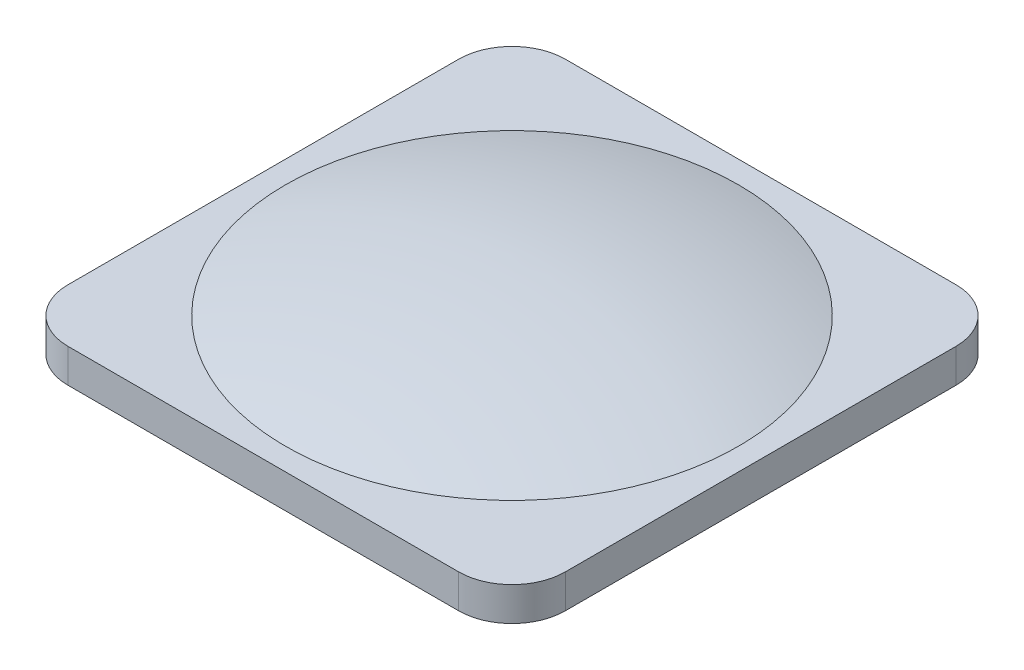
ISO-10303-21;
HEADER;
FILE_DESCRIPTION(('STEP AP214'),'2;1');
FILE_NAME('part.step','',(''),(''),'','','');
FILE_SCHEMA(('AUTOMOTIVE_DESIGN { 1 0 10303 214 1 1 1 1 }'));
ENDSEC;
DATA;
#1=APPLICATION_CONTEXT('core data for automotive mechanical design processes');
#2=APPLICATION_PROTOCOL_DEFINITION('international standard','automotive_design',2000,#1);
#3=PRODUCT_CONTEXT('',#1,'mechanical');
#4=PRODUCT('Part','Part','',(#3));
#5=PRODUCT_RELATED_PRODUCT_CATEGORY('part','',(#4));
#6=PRODUCT_DEFINITION_FORMATION('','',#4);
#7=PRODUCT_DEFINITION_CONTEXT('part definition',#1,'design');
#8=PRODUCT_DEFINITION('design','',#6,#7);
#9=PRODUCT_DEFINITION_SHAPE('','',#8);
#10=(LENGTH_UNIT() NAMED_UNIT(*) SI_UNIT(.MILLI.,.METRE.));
#11=(NAMED_UNIT(*) PLANE_ANGLE_UNIT() SI_UNIT($,.RADIAN.));
#12=(NAMED_UNIT(*) SI_UNIT($,.STERADIAN.) SOLID_ANGLE_UNIT());
#13=UNCERTAINTY_MEASURE_WITH_UNIT(LENGTH_MEASURE(1.E-05),#10,'distance_accuracy_value','');
#14=(GEOMETRIC_REPRESENTATION_CONTEXT(3) GLOBAL_UNCERTAINTY_ASSIGNED_CONTEXT((#13)) GLOBAL_UNIT_ASSIGNED_CONTEXT((#10,
#11,#12)) REPRESENTATION_CONTEXT('',''));
#15=CARTESIAN_POINT('',(0.,0.,0.));
#16=DIRECTION('',(0.,0.,1.));
#17=DIRECTION('',(1.,0.,0.));
#18=AXIS2_PLACEMENT_3D('',#15,#16,#17);
#19=CARTESIAN_POINT('',(0.,0.,-140.));
#20=DIRECTION('',(0.,-1.,0.));
#21=DIRECTION('',(0.,0.,-1.));
#22=AXIS2_PLACEMENT_3D('',#19,#20,#21);
#23=PLANE('',#22);
#24=DIRECTION('',(0.,0.,-1.));
#25=VECTOR('',#24,1.);
#26=CARTESIAN_POINT('',(140.,0.,0.));
#27=LINE('',#26,#25);
#28=CARTESIAN_POINT('',(140.,0.,-15.));
#29=VERTEX_POINT('',#28);
#30=CARTESIAN_POINT('',(140.,0.,-125.));
#31=VERTEX_POINT('',#30);
#32=EDGE_CURVE('E215',#29,#31,#27,.T.);
#33=ORIENTED_EDGE('',*,*,#32,.F.);
#34=CARTESIAN_POINT('',(125.,0.,-15.));
#35=DIRECTION('',(0.,-1.,0.));
#36=DIRECTION('',(0.,0.,-1.));
#37=AXIS2_PLACEMENT_3D('',#34,#35,#36);
#38=CIRCLE('',#37,15.);
#39=CARTESIAN_POINT('',(125.,0.,0.));
#40=VERTEX_POINT('',#39);
#41=EDGE_CURVE('E242',#29,#40,#38,.T.);
#42=ORIENTED_EDGE('',*,*,#41,.T.);
#43=DIRECTION('',(1.,0.,0.));
#44=VECTOR('',#43,1.);
#45=CARTESIAN_POINT('',(0.,0.,0.));
#46=LINE('',#45,#44);
#47=CARTESIAN_POINT('',(15.,0.,0.));
#48=VERTEX_POINT('',#47);
#49=EDGE_CURVE('E212',#48,#40,#46,.T.);
#50=ORIENTED_EDGE('',*,*,#49,.F.);
#51=CARTESIAN_POINT('',(15.,0.,-15.));
#52=DIRECTION('',(0.,-1.,0.));
#53=DIRECTION('',(0.,0.,-1.));
#54=AXIS2_PLACEMENT_3D('',#51,#52,#53);
#55=CIRCLE('',#54,15.);
#56=CARTESIAN_POINT('',(0.,0.,-15.));
#57=VERTEX_POINT('',#56);
#58=EDGE_CURVE('E240',#48,#57,#55,.T.);
#59=ORIENTED_EDGE('',*,*,#58,.T.);
#60=DIRECTION('',(0.,0.,1.));
#61=VECTOR('',#60,1.);
#62=CARTESIAN_POINT('',(0.,0.,0.));
#63=LINE('',#62,#61);
#64=CARTESIAN_POINT('',(0.,0.,-125.));
#65=VERTEX_POINT('',#64);
#66=EDGE_CURVE('E209',#65,#57,#63,.T.);
#67=ORIENTED_EDGE('',*,*,#66,.F.);
#68=CARTESIAN_POINT('',(15.,0.,-125.));
#69=DIRECTION('',(0.,-1.,0.));
#70=DIRECTION('',(0.,0.,-1.));
#71=AXIS2_PLACEMENT_3D('',#68,#69,#70);
#72=CIRCLE('',#71,15.);
#73=CARTESIAN_POINT('',(15.,0.,-140.));
#74=VERTEX_POINT('',#73);
#75=EDGE_CURVE('E238',#65,#74,#72,.T.);
#76=ORIENTED_EDGE('',*,*,#75,.T.);
#77=DIRECTION('',(-1.,0.,0.));
#78=VECTOR('',#77,1.);
#79=CARTESIAN_POINT('',(0.,0.,-140.));
#80=LINE('',#79,#78);
#81=CARTESIAN_POINT('',(125.,0.,-140.));
#82=VERTEX_POINT('',#81);
#83=EDGE_CURVE('E218',#82,#74,#80,.T.);
#84=ORIENTED_EDGE('',*,*,#83,.F.);
#85=CARTESIAN_POINT('',(125.,0.,-125.));
#86=DIRECTION('',(0.,-1.,0.));
#87=DIRECTION('',(0.,0.,-1.));
#88=AXIS2_PLACEMENT_3D('',#85,#86,#87);
#89=CIRCLE('',#88,15.);
#90=EDGE_CURVE('E236',#82,#31,#89,.T.);
#91=ORIENTED_EDGE('',*,*,#90,.T.);
#92=EDGE_LOOP('',(#33,#42,#50,#59,#67,#76,#84,#91));
#93=FACE_BOUND('',#92,.T.);
#94=CARTESIAN_POINT('',(125.,0.,-15.));
#95=DIRECTION('',(0.,-1.,0.));
#96=DIRECTION('',(0.,0.,-1.));
#97=AXIS2_PLACEMENT_3D('',#94,#95,#96);
#98=CIRCLE('',#97,13.5);
#99=CARTESIAN_POINT('',(138.5,0.,-15.));
#100=VERTEX_POINT('',#99);
#101=CARTESIAN_POINT('',(125.,0.,-1.5));
#102=VERTEX_POINT('',#101);
#103=EDGE_CURVE('E181',#100,#102,#98,.T.);
#104=ORIENTED_EDGE('',*,*,#103,.F.);
#105=DIRECTION('',(0.,0.,-1.));
#106=VECTOR('',#105,1.);
#107=CARTESIAN_POINT('',(138.5,0.,-140.));
#108=LINE('',#107,#106);
#109=CARTESIAN_POINT('',(138.5,0.,-125.));
#110=VERTEX_POINT('',#109);
#111=EDGE_CURVE('E199',#100,#110,#108,.T.);
#112=ORIENTED_EDGE('',*,*,#111,.T.);
#113=CARTESIAN_POINT('',(125.,0.,-125.));
#114=DIRECTION('',(0.,-1.,0.));
#115=DIRECTION('',(0.,0.,-1.));
#116=AXIS2_PLACEMENT_3D('',#113,#114,#115);
#117=CIRCLE('',#116,13.5);
#118=CARTESIAN_POINT('',(125.,0.,-138.5));
#119=VERTEX_POINT('',#118);
#120=EDGE_CURVE('E184',#119,#110,#117,.T.);
#121=ORIENTED_EDGE('',*,*,#120,.F.);
#122=DIRECTION('',(-1.,0.,0.));
#123=VECTOR('',#122,1.);
#124=CARTESIAN_POINT('',(0.,0.,-138.5));
#125=LINE('',#124,#123);
#126=CARTESIAN_POINT('',(15.,0.,-138.5));
#127=VERTEX_POINT('',#126);
#128=EDGE_CURVE('E44',#119,#127,#125,.T.);
#129=ORIENTED_EDGE('',*,*,#128,.T.);
#130=CARTESIAN_POINT('',(15.,0.,-125.));
#131=DIRECTION('',(0.,-1.,0.));
#132=DIRECTION('',(0.,0.,-1.));
#133=AXIS2_PLACEMENT_3D('',#130,#131,#132);
#134=CIRCLE('',#133,13.5);
#135=CARTESIAN_POINT('',(1.5,0.,-125.));
#136=VERTEX_POINT('',#135);
#137=EDGE_CURVE('E196',#136,#127,#134,.T.);
#138=ORIENTED_EDGE('',*,*,#137,.F.);
#139=DIRECTION('',(0.,0.,1.));
#140=VECTOR('',#139,1.);
#141=CARTESIAN_POINT('',(1.5,0.,-140.));
#142=LINE('',#141,#140);
#143=CARTESIAN_POINT('',(1.5,0.,-15.));
#144=VERTEX_POINT('',#143);
#145=EDGE_CURVE('E192',#136,#144,#142,.T.);
#146=ORIENTED_EDGE('',*,*,#145,.T.);
#147=CARTESIAN_POINT('',(15.,0.,-15.));
#148=DIRECTION('',(0.,-1.,0.));
#149=DIRECTION('',(0.,0.,-1.));
#150=AXIS2_PLACEMENT_3D('',#147,#148,#149);
#151=CIRCLE('',#150,13.5);
#152=CARTESIAN_POINT('',(15.,0.,-1.5));
#153=VERTEX_POINT('',#152);
#154=EDGE_CURVE('E150',#153,#144,#151,.T.);
#155=ORIENTED_EDGE('',*,*,#154,.F.);
#156=DIRECTION('',(1.,0.,0.));
#157=VECTOR('',#156,1.);
#158=CARTESIAN_POINT('',(0.,0.,-1.5));
#159=LINE('',#158,#157);
#160=EDGE_CURVE('E194',#153,#102,#159,.T.);
#161=ORIENTED_EDGE('',*,*,#160,.T.);
#162=EDGE_LOOP('',(#104,#112,#121,#129,#138,#146,#155,#161));
#163=FACE_BOUND('',#162,.T.);
#164=ADVANCED_FACE('F29',(#93,#163),#23,.T.);
#165=CARTESIAN_POINT('',(0.,9.5,0.));
#166=DIRECTION('',(1.,0.,0.));
#167=DIRECTION('',(0.,0.,-1.));
#168=AXIS2_PLACEMENT_3D('',#165,#166,#167);
#169=PLANE('',#168);
#170=ORIENTED_EDGE('',*,*,#66,.T.);
#171=DIRECTION('',(0.,-1.,0.));
#172=VECTOR('',#171,1.);
#173=CARTESIAN_POINT('',(0.,9.5,-15.));
#174=LINE('',#173,#172);
#175=CARTESIAN_POINT('',(0.,9.5,-15.));
#176=VERTEX_POINT('',#175);
#177=EDGE_CURVE('E260',#57,#176,#174,.F.);
#178=ORIENTED_EDGE('',*,*,#177,.T.);
#179=DIRECTION('',(0.,0.,1.));
#180=VECTOR('',#179,1.);
#181=CARTESIAN_POINT('',(0.,9.5,0.));
#182=LINE('',#181,#180);
#183=CARTESIAN_POINT('',(0.,9.5,-125.));
#184=VERTEX_POINT('',#183);
#185=EDGE_CURVE('E220',#184,#176,#182,.T.);
#186=ORIENTED_EDGE('',*,*,#185,.F.);
#187=DIRECTION('',(0.,-1.,0.));
#188=VECTOR('',#187,1.);
#189=CARTESIAN_POINT('',(0.,9.5,-125.));
#190=LINE('',#189,#188);
#191=EDGE_CURVE('E257',#184,#65,#190,.T.);
#192=ORIENTED_EDGE('',*,*,#191,.T.);
#193=EDGE_LOOP('',(#170,#178,#186,#192));
#194=FACE_BOUND('',#193,.T.);
#195=ADVANCED_FACE('F31',(#194),#169,.F.);
#196=CARTESIAN_POINT('',(0.,9.5,0.));
#197=DIRECTION('',(0.,0.,-1.));
#198=DIRECTION('',(-1.,0.,0.));
#199=AXIS2_PLACEMENT_3D('',#196,#197,#198);
#200=PLANE('',#199);
#201=ORIENTED_EDGE('',*,*,#49,.T.);
#202=DIRECTION('',(0.,-1.,0.));
#203=VECTOR('',#202,1.);
#204=CARTESIAN_POINT('',(125.,9.5,0.));
#205=LINE('',#204,#203);
#206=CARTESIAN_POINT('',(125.,9.5,0.));
#207=VERTEX_POINT('',#206);
#208=EDGE_CURVE('E247',#40,#207,#205,.F.);
#209=ORIENTED_EDGE('',*,*,#208,.T.);
#210=DIRECTION('',(1.,0.,0.));
#211=VECTOR('',#210,1.);
#212=CARTESIAN_POINT('',(0.,9.5,0.));
#213=LINE('',#212,#211);
#214=CARTESIAN_POINT('',(15.,9.5,0.));
#215=VERTEX_POINT('',#214);
#216=EDGE_CURVE('E223',#215,#207,#213,.T.);
#217=ORIENTED_EDGE('',*,*,#216,.F.);
#218=DIRECTION('',(0.,-1.,0.));
#219=VECTOR('',#218,1.);
#220=CARTESIAN_POINT('',(15.,9.5,0.));
#221=LINE('',#220,#219);
#222=EDGE_CURVE('E244',#215,#48,#221,.T.);
#223=ORIENTED_EDGE('',*,*,#222,.T.);
#224=EDGE_LOOP('',(#201,#209,#217,#223));
#225=FACE_BOUND('',#224,.T.);
#226=ADVANCED_FACE('F287',(#225),#200,.F.);
#227=CARTESIAN_POINT('',(140.,9.5,0.));
#228=DIRECTION('',(-1.,0.,0.));
#229=DIRECTION('',(0.,0.,1.));
#230=AXIS2_PLACEMENT_3D('',#227,#228,#229);
#231=PLANE('',#230);
#232=DIRECTION('',(0.,0.,-1.));
#233=VECTOR('',#232,1.);
#234=CARTESIAN_POINT('',(140.,9.5,0.));
#235=LINE('',#234,#233);
#236=CARTESIAN_POINT('',(140.,9.5,-15.));
#237=VERTEX_POINT('',#236);
#238=CARTESIAN_POINT('',(140.,9.5,-125.));
#239=VERTEX_POINT('',#238);
#240=EDGE_CURVE('E226',#237,#239,#235,.T.);
#241=ORIENTED_EDGE('',*,*,#240,.F.);
#242=DIRECTION('',(0.,-1.,0.));
#243=VECTOR('',#242,1.);
#244=CARTESIAN_POINT('',(140.,9.5,-15.));
#245=LINE('',#244,#243);
#246=EDGE_CURVE('E233',#237,#29,#245,.T.);
#247=ORIENTED_EDGE('',*,*,#246,.T.);
#248=ORIENTED_EDGE('',*,*,#32,.T.);
#249=DIRECTION('',(0.,-1.,0.));
#250=VECTOR('',#249,1.);
#251=CARTESIAN_POINT('',(140.,9.5,-125.));
#252=LINE('',#251,#250);
#253=EDGE_CURVE('E231',#31,#239,#252,.F.);
#254=ORIENTED_EDGE('',*,*,#253,.T.);
#255=EDGE_LOOP('',(#241,#247,#248,#254));
#256=FACE_BOUND('',#255,.T.);
#257=ADVANCED_FACE('F295',(#256),#231,.F.);
#258=CARTESIAN_POINT('',(0.,9.5,-140.));
#259=DIRECTION('',(0.,0.,1.));
#260=DIRECTION('',(1.,0.,0.));
#261=AXIS2_PLACEMENT_3D('',#258,#259,#260);
#262=PLANE('',#261);
#263=ORIENTED_EDGE('',*,*,#83,.T.);
#264=DIRECTION('',(0.,-1.,0.));
#265=VECTOR('',#264,1.);
#266=CARTESIAN_POINT('',(15.,9.5,-140.));
#267=LINE('',#266,#265);
#268=CARTESIAN_POINT('',(15.,9.5,-140.));
#269=VERTEX_POINT('',#268);
#270=EDGE_CURVE('E11',#74,#269,#267,.F.);
#271=ORIENTED_EDGE('',*,*,#270,.T.);
#272=DIRECTION('',(-1.,0.,0.));
#273=VECTOR('',#272,1.);
#274=CARTESIAN_POINT('',(0.,9.5,-140.));
#275=LINE('',#274,#273);
#276=CARTESIAN_POINT('',(125.,9.5,-140.));
#277=VERTEX_POINT('',#276);
#278=EDGE_CURVE('E229',#277,#269,#275,.T.);
#279=ORIENTED_EDGE('',*,*,#278,.F.);
#280=DIRECTION('',(0.,-1.,0.));
#281=VECTOR('',#280,1.);
#282=CARTESIAN_POINT('',(125.,9.5,-140.));
#283=LINE('',#282,#281);
#284=EDGE_CURVE('E37',#277,#82,#283,.T.);
#285=ORIENTED_EDGE('',*,*,#284,.T.);
#286=EDGE_LOOP('',(#263,#271,#279,#285));
#287=FACE_BOUND('',#286,.T.);
#288=ADVANCED_FACE('F264',(#287),#262,.F.);
#289=CARTESIAN_POINT('',(0.,9.5,-140.));
#290=DIRECTION('',(0.,-1.,0.));
#291=DIRECTION('',(0.,0.,-1.));
#292=AXIS2_PLACEMENT_3D('',#289,#290,#291);
#293=PLANE('',#292);
#294=CARTESIAN_POINT('',(70.,9.5,-70.));
#295=DIRECTION('',(0.,-1.,0.));
#296=DIRECTION('',(0.,0.,-1.));
#297=AXIS2_PLACEMENT_3D('',#294,#295,#296);
#298=CIRCLE('',#297,63.75);
#299=CARTESIAN_POINT('',(70.,9.5,-133.75));
#300=VERTEX_POINT('',#299);
#301=EDGE_CURVE('E191',#300,#300,#298,.T.);
#302=ORIENTED_EDGE('',*,*,#301,.T.);
#303=EDGE_LOOP('',(#302));
#304=FACE_BOUND('',#303,.T.);
#305=ORIENTED_EDGE('',*,*,#216,.T.);
#306=CARTESIAN_POINT('',(125.,9.5,-15.));
#307=DIRECTION('',(0.,-1.,0.));
#308=DIRECTION('',(0.,0.,-1.));
#309=AXIS2_PLACEMENT_3D('',#306,#307,#308);
#310=CIRCLE('',#309,15.);
#311=EDGE_CURVE('E255',#207,#237,#310,.F.);
#312=ORIENTED_EDGE('',*,*,#311,.T.);
#313=ORIENTED_EDGE('',*,*,#240,.T.);
#314=CARTESIAN_POINT('',(125.,9.5,-125.));
#315=DIRECTION('',(0.,-1.,0.));
#316=DIRECTION('',(0.,0.,-1.));
#317=AXIS2_PLACEMENT_3D('',#314,#315,#316);
#318=CIRCLE('',#317,15.);
#319=EDGE_CURVE('E249',#239,#277,#318,.F.);
#320=ORIENTED_EDGE('',*,*,#319,.T.);
#321=ORIENTED_EDGE('',*,*,#278,.T.);
#322=CARTESIAN_POINT('',(15.,9.5,-125.));
#323=DIRECTION('',(0.,-1.,0.));
#324=DIRECTION('',(0.,0.,-1.));
#325=AXIS2_PLACEMENT_3D('',#322,#323,#324);
#326=CIRCLE('',#325,15.);
#327=EDGE_CURVE('E251',#269,#184,#326,.F.);
#328=ORIENTED_EDGE('',*,*,#327,.T.);
#329=ORIENTED_EDGE('',*,*,#185,.T.);
#330=CARTESIAN_POINT('',(15.,9.5,-15.));
#331=DIRECTION('',(0.,-1.,0.));
#332=DIRECTION('',(0.,0.,-1.));
#333=AXIS2_PLACEMENT_3D('',#330,#331,#332);
#334=CIRCLE('',#333,15.);
#335=EDGE_CURVE('E253',#176,#215,#334,.F.);
#336=ORIENTED_EDGE('',*,*,#335,.T.);
#337=EDGE_LOOP('',(#305,#312,#313,#320,#321,#328,#329,#336));
#338=FACE_BOUND('',#337,.T.);
#339=ADVANCED_FACE('F280',(#304,#338),#293,.F.);
#340=CARTESIAN_POINT('',(125.,9.5,-15.));
#341=DIRECTION('',(0.,-1.,0.));
#342=DIRECTION('',(0.,0.,-1.));
#343=AXIS2_PLACEMENT_3D('',#340,#341,#342);
#344=CYLINDRICAL_SURFACE('',#343,15.);
#345=ORIENTED_EDGE('',*,*,#311,.F.);
#346=ORIENTED_EDGE('',*,*,#208,.F.);
#347=ORIENTED_EDGE('',*,*,#41,.F.);
#348=ORIENTED_EDGE('',*,*,#246,.F.);
#349=EDGE_LOOP('',(#345,#346,#347,#348));
#350=FACE_BOUND('',#349,.T.);
#351=ADVANCED_FACE('F292',(#350),#344,.T.);
#352=CARTESIAN_POINT('',(15.,9.5,-15.));
#353=DIRECTION('',(0.,-1.,0.));
#354=DIRECTION('',(0.,0.,-1.));
#355=AXIS2_PLACEMENT_3D('',#352,#353,#354);
#356=CYLINDRICAL_SURFACE('',#355,15.);
#357=ORIENTED_EDGE('',*,*,#335,.F.);
#358=ORIENTED_EDGE('',*,*,#177,.F.);
#359=ORIENTED_EDGE('',*,*,#58,.F.);
#360=ORIENTED_EDGE('',*,*,#222,.F.);
#361=EDGE_LOOP('',(#357,#358,#359,#360));
#362=FACE_BOUND('',#361,.T.);
#363=ADVANCED_FACE('F284',(#362),#356,.T.);
#364=CARTESIAN_POINT('',(15.,9.5,-125.));
#365=DIRECTION('',(0.,-1.,0.));
#366=DIRECTION('',(0.,0.,-1.));
#367=AXIS2_PLACEMENT_3D('',#364,#365,#366);
#368=CYLINDRICAL_SURFACE('',#367,15.);
#369=ORIENTED_EDGE('',*,*,#327,.F.);
#370=ORIENTED_EDGE('',*,*,#270,.F.);
#371=ORIENTED_EDGE('',*,*,#75,.F.);
#372=ORIENTED_EDGE('',*,*,#191,.F.);
#373=EDGE_LOOP('',(#369,#370,#371,#372));
#374=FACE_BOUND('',#373,.T.);
#375=ADVANCED_FACE('F274',(#374),#368,.T.);
#376=CARTESIAN_POINT('',(125.,9.5,-125.));
#377=DIRECTION('',(0.,-1.,0.));
#378=DIRECTION('',(0.,0.,-1.));
#379=AXIS2_PLACEMENT_3D('',#376,#377,#378);
#380=CYLINDRICAL_SURFACE('',#379,15.);
#381=ORIENTED_EDGE('',*,*,#319,.F.);
#382=ORIENTED_EDGE('',*,*,#253,.F.);
#383=ORIENTED_EDGE('',*,*,#90,.F.);
#384=ORIENTED_EDGE('',*,*,#284,.F.);
#385=EDGE_LOOP('',(#381,#382,#383,#384));
#386=FACE_BOUND('',#385,.T.);
#387=ADVANCED_FACE('F297',(#386),#380,.T.);
#388=CARTESIAN_POINT('',(70.,-188.703125,-70.));
#389=DIRECTION('',(0.,-1.,0.));
#390=DIRECTION('',(-1.,0.,0.));
#391=AXIS2_PLACEMENT_3D('',#388,#389,#390);
#392=SPHERICAL_SURFACE('',#391,208.203125);
#393=ORIENTED_EDGE('',*,*,#301,.F.);
#394=EDGE_LOOP('',(#393));
#395=FACE_BOUND('',#394,.T.);
#396=ADVANCED_FACE('F299',(#395),#392,.T.);
#397=CARTESIAN_POINT('',(1.5,9.5,0.));
#398=DIRECTION('',(1.,0.,0.));
#399=DIRECTION('',(0.,0.,-1.));
#400=AXIS2_PLACEMENT_3D('',#397,#398,#399);
#401=PLANE('',#400);
#402=ORIENTED_EDGE('',*,*,#145,.F.);
#403=DIRECTION('',(0.,1.,0.));
#404=VECTOR('',#403,1.);
#405=CARTESIAN_POINT('',(1.5,9.5,-125.));
#406=LINE('',#405,#404);
#407=CARTESIAN_POINT('',(1.5,8.,-125.));
#408=VERTEX_POINT('',#407);
#409=EDGE_CURVE('E155',#408,#136,#406,.F.);
#410=ORIENTED_EDGE('',*,*,#409,.F.);
#411=DIRECTION('',(0.,0.,1.));
#412=VECTOR('',#411,1.);
#413=CARTESIAN_POINT('',(1.5,8.,-140.));
#414=LINE('',#413,#412);
#415=CARTESIAN_POINT('',(1.5,8.,-15.));
#416=VERTEX_POINT('',#415);
#417=EDGE_CURVE('E159',#408,#416,#414,.T.);
#418=ORIENTED_EDGE('',*,*,#417,.T.);
#419=DIRECTION('',(0.,1.,0.));
#420=VECTOR('',#419,1.);
#421=CARTESIAN_POINT('',(1.5,9.5,-15.));
#422=LINE('',#421,#420);
#423=EDGE_CURVE('E143',#144,#416,#422,.T.);
#424=ORIENTED_EDGE('',*,*,#423,.F.);
#425=EDGE_LOOP('',(#402,#410,#418,#424));
#426=FACE_BOUND('',#425,.T.);
#427=ADVANCED_FACE('F160',(#426),#401,.T.);
#428=CARTESIAN_POINT('',(0.,9.5,-1.5));
#429=DIRECTION('',(0.,0.,-1.));
#430=DIRECTION('',(-1.,0.,0.));
#431=AXIS2_PLACEMENT_3D('',#428,#429,#430);
#432=PLANE('',#431);
#433=ORIENTED_EDGE('',*,*,#160,.F.);
#434=DIRECTION('',(0.,1.,0.));
#435=VECTOR('',#434,1.);
#436=CARTESIAN_POINT('',(15.,9.5,-1.5));
#437=LINE('',#436,#435);
#438=CARTESIAN_POINT('',(15.,8.,-1.5));
#439=VERTEX_POINT('',#438);
#440=EDGE_CURVE('E179',#439,#153,#437,.F.);
#441=ORIENTED_EDGE('',*,*,#440,.F.);
#442=DIRECTION('',(1.,0.,0.));
#443=VECTOR('',#442,1.);
#444=CARTESIAN_POINT('',(0.,8.,-1.5));
#445=LINE('',#444,#443);
#446=CARTESIAN_POINT('',(125.,8.,-1.5));
#447=VERTEX_POINT('',#446);
#448=EDGE_CURVE('E163',#439,#447,#445,.T.);
#449=ORIENTED_EDGE('',*,*,#448,.T.);
#450=DIRECTION('',(0.,1.,0.));
#451=VECTOR('',#450,1.);
#452=CARTESIAN_POINT('',(125.,9.5,-1.5));
#453=LINE('',#452,#451);
#454=EDGE_CURVE('E177',#102,#447,#453,.T.);
#455=ORIENTED_EDGE('',*,*,#454,.F.);
#456=EDGE_LOOP('',(#433,#441,#449,#455));
#457=FACE_BOUND('',#456,.T.);
#458=ADVANCED_FACE('F365',(#457),#432,.T.);
#459=CARTESIAN_POINT('',(138.5,9.5,0.));
#460=DIRECTION('',(-1.,0.,0.));
#461=DIRECTION('',(0.,0.,1.));
#462=AXIS2_PLACEMENT_3D('',#459,#460,#461);
#463=PLANE('',#462);
#464=DIRECTION('',(0.,0.,-1.));
#465=VECTOR('',#464,1.);
#466=CARTESIAN_POINT('',(138.5,8.,-140.));
#467=LINE('',#466,#465);
#468=CARTESIAN_POINT('',(138.5,8.,-15.));
#469=VERTEX_POINT('',#468);
#470=CARTESIAN_POINT('',(138.5,8.,-125.));
#471=VERTEX_POINT('',#470);
#472=EDGE_CURVE('E439',#469,#471,#467,.T.);
#473=ORIENTED_EDGE('',*,*,#472,.T.);
#474=DIRECTION('',(0.,1.,0.));
#475=VECTOR('',#474,1.);
#476=CARTESIAN_POINT('',(138.5,9.5,-125.));
#477=LINE('',#476,#475);
#478=EDGE_CURVE('E185',#110,#471,#477,.T.);
#479=ORIENTED_EDGE('',*,*,#478,.F.);
#480=ORIENTED_EDGE('',*,*,#111,.F.);
#481=DIRECTION('',(0.,1.,0.));
#482=VECTOR('',#481,1.);
#483=CARTESIAN_POINT('',(138.5,9.5,-15.));
#484=LINE('',#483,#482);
#485=EDGE_CURVE('E182',#469,#100,#484,.F.);
#486=ORIENTED_EDGE('',*,*,#485,.F.);
#487=EDGE_LOOP('',(#473,#479,#480,#486));
#488=FACE_BOUND('',#487,.T.);
#489=ADVANCED_FACE('F372',(#488),#463,.T.);
#490=CARTESIAN_POINT('',(0.,9.5,-138.5));
#491=DIRECTION('',(0.,0.,1.));
#492=DIRECTION('',(1.,0.,0.));
#493=AXIS2_PLACEMENT_3D('',#490,#491,#492);
#494=PLANE('',#493);
#495=ORIENTED_EDGE('',*,*,#128,.F.);
#496=DIRECTION('',(0.,1.,0.));
#497=VECTOR('',#496,1.);
#498=CARTESIAN_POINT('',(125.,9.5,-138.5));
#499=LINE('',#498,#497);
#500=CARTESIAN_POINT('',(125.,8.,-138.5));
#501=VERTEX_POINT('',#500);
#502=EDGE_CURVE('E154',#501,#119,#499,.F.);
#503=ORIENTED_EDGE('',*,*,#502,.F.);
#504=DIRECTION('',(-1.,0.,0.));
#505=VECTOR('',#504,1.);
#506=CARTESIAN_POINT('',(0.,8.,-138.5));
#507=LINE('',#506,#505);
#508=CARTESIAN_POINT('',(15.,8.,-138.5));
#509=VERTEX_POINT('',#508);
#510=EDGE_CURVE('E187',#501,#509,#507,.T.);
#511=ORIENTED_EDGE('',*,*,#510,.T.);
#512=DIRECTION('',(0.,1.,0.));
#513=VECTOR('',#512,1.);
#514=CARTESIAN_POINT('',(15.,9.5,-138.5));
#515=LINE('',#514,#513);
#516=EDGE_CURVE('E189',#127,#509,#515,.T.);
#517=ORIENTED_EDGE('',*,*,#516,.F.);
#518=EDGE_LOOP('',(#495,#503,#511,#517));
#519=FACE_BOUND('',#518,.T.);
#520=ADVANCED_FACE('F380',(#519),#494,.T.);
#521=CARTESIAN_POINT('',(0.,8.,-140.));
#522=DIRECTION('',(0.,-1.,0.));
#523=DIRECTION('',(0.,0.,-1.));
#524=AXIS2_PLACEMENT_3D('',#521,#522,#523);
#525=PLANE('',#524);
#526=CARTESIAN_POINT('',(70.,8.00000000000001,-70.));
#527=DIRECTION('',(0.,-1.,0.));
#528=DIRECTION('',(0.,0.,-1.));
#529=AXIS2_PLACEMENT_3D('',#526,#527,#528);
#530=CIRCLE('',#529,63.5142700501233);
#531=CARTESIAN_POINT('',(70.,8.00000000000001,-133.514270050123));
#532=VERTEX_POINT('',#531);
#533=EDGE_CURVE('E195',#532,#532,#530,.T.);
#534=ORIENTED_EDGE('',*,*,#533,.F.);
#535=EDGE_LOOP('',(#534));
#536=FACE_BOUND('',#535,.T.);
#537=ORIENTED_EDGE('',*,*,#448,.F.);
#538=CARTESIAN_POINT('',(15.,8.,-15.));
#539=DIRECTION('',(0.,-1.,0.));
#540=DIRECTION('',(0.,0.,-1.));
#541=AXIS2_PLACEMENT_3D('',#538,#539,#540);
#542=CIRCLE('',#541,13.5);
#543=EDGE_CURVE('E147',#416,#439,#542,.F.);
#544=ORIENTED_EDGE('',*,*,#543,.F.);
#545=ORIENTED_EDGE('',*,*,#417,.F.);
#546=CARTESIAN_POINT('',(15.,8.,-125.));
#547=DIRECTION('',(0.,-1.,0.));
#548=DIRECTION('',(0.,0.,-1.));
#549=AXIS2_PLACEMENT_3D('',#546,#547,#548);
#550=CIRCLE('',#549,13.5);
#551=EDGE_CURVE('E170',#509,#408,#550,.F.);
#552=ORIENTED_EDGE('',*,*,#551,.F.);
#553=ORIENTED_EDGE('',*,*,#510,.F.);
#554=CARTESIAN_POINT('',(125.,8.,-125.));
#555=DIRECTION('',(0.,-1.,0.));
#556=DIRECTION('',(0.,0.,-1.));
#557=AXIS2_PLACEMENT_3D('',#554,#555,#556);
#558=CIRCLE('',#557,13.5);
#559=EDGE_CURVE('E173',#471,#501,#558,.F.);
#560=ORIENTED_EDGE('',*,*,#559,.F.);
#561=ORIENTED_EDGE('',*,*,#472,.F.);
#562=CARTESIAN_POINT('',(125.,8.,-15.));
#563=DIRECTION('',(0.,-1.,0.));
#564=DIRECTION('',(0.,0.,-1.));
#565=AXIS2_PLACEMENT_3D('',#562,#563,#564);
#566=CIRCLE('',#565,13.5);
#567=EDGE_CURVE('E169',#447,#469,#566,.F.);
#568=ORIENTED_EDGE('',*,*,#567,.F.);
#569=EDGE_LOOP('',(#537,#544,#545,#552,#553,#560,#561,#568));
#570=FACE_BOUND('',#569,.T.);
#571=ADVANCED_FACE('F165',(#536,#570),#525,.T.);
#572=CARTESIAN_POINT('',(125.,9.5,-15.));
#573=DIRECTION('',(0.,-1.,0.));
#574=DIRECTION('',(0.,0.,-1.));
#575=AXIS2_PLACEMENT_3D('',#572,#573,#574);
#576=CYLINDRICAL_SURFACE('',#575,13.5);
#577=ORIENTED_EDGE('',*,*,#567,.T.);
#578=ORIENTED_EDGE('',*,*,#485,.T.);
#579=ORIENTED_EDGE('',*,*,#103,.T.);
#580=ORIENTED_EDGE('',*,*,#454,.T.);
#581=EDGE_LOOP('',(#577,#578,#579,#580));
#582=FACE_BOUND('',#581,.T.);
#583=ADVANCED_FACE('F394',(#582),#576,.F.);
#584=CARTESIAN_POINT('',(15.,9.5,-15.));
#585=DIRECTION('',(0.,-1.,0.));
#586=DIRECTION('',(0.,0.,-1.));
#587=AXIS2_PLACEMENT_3D('',#584,#585,#586);
#588=CYLINDRICAL_SURFACE('',#587,13.5);
#589=ORIENTED_EDGE('',*,*,#543,.T.);
#590=ORIENTED_EDGE('',*,*,#440,.T.);
#591=ORIENTED_EDGE('',*,*,#154,.T.);
#592=ORIENTED_EDGE('',*,*,#423,.T.);
#593=EDGE_LOOP('',(#589,#590,#591,#592));
#594=FACE_BOUND('',#593,.T.);
#595=ADVANCED_FACE('F145',(#594),#588,.F.);
#596=CARTESIAN_POINT('',(15.,9.5,-125.));
#597=DIRECTION('',(0.,-1.,0.));
#598=DIRECTION('',(0.,0.,-1.));
#599=AXIS2_PLACEMENT_3D('',#596,#597,#598);
#600=CYLINDRICAL_SURFACE('',#599,13.5);
#601=ORIENTED_EDGE('',*,*,#551,.T.);
#602=ORIENTED_EDGE('',*,*,#409,.T.);
#603=ORIENTED_EDGE('',*,*,#137,.T.);
#604=ORIENTED_EDGE('',*,*,#516,.T.);
#605=EDGE_LOOP('',(#601,#602,#603,#604));
#606=FACE_BOUND('',#605,.T.);
#607=ADVANCED_FACE('F409',(#606),#600,.F.);
#608=CARTESIAN_POINT('',(125.,9.5,-125.));
#609=DIRECTION('',(0.,-1.,0.));
#610=DIRECTION('',(0.,0.,-1.));
#611=AXIS2_PLACEMENT_3D('',#608,#609,#610);
#612=CYLINDRICAL_SURFACE('',#611,13.5);
#613=ORIENTED_EDGE('',*,*,#559,.T.);
#614=ORIENTED_EDGE('',*,*,#502,.T.);
#615=ORIENTED_EDGE('',*,*,#120,.T.);
#616=ORIENTED_EDGE('',*,*,#478,.T.);
#617=EDGE_LOOP('',(#613,#614,#615,#616));
#618=FACE_BOUND('',#617,.T.);
#619=ADVANCED_FACE('F416',(#618),#612,.F.);
#620=CARTESIAN_POINT('',(70.,-188.703125,-70.));
#621=DIRECTION('',(0.,-1.,0.));
#622=DIRECTION('',(-1.,0.,0.));
#623=AXIS2_PLACEMENT_3D('',#620,#621,#622);
#624=SPHERICAL_SURFACE('',#623,206.703125);
#625=ORIENTED_EDGE('',*,*,#533,.T.);
#626=EDGE_LOOP('',(#625));
#627=FACE_BOUND('',#626,.T.);
#628=ADVANCED_FACE('F424',(#627),#624,.F.);
#629=CLOSED_SHELL('',(#164,#195,#226,#257,#288,#339,#351,#363,#375,#387,#396,#427,#458,#489,
#520,#571,#583,#595,#607,#619,#628));
#630=MANIFOLD_SOLID_BREP('B2',#629);
#631=ADVANCED_BREP_SHAPE_REPRESENTATION('',(#18,#630),#14);
#632=SHAPE_DEFINITION_REPRESENTATION(#9,#631);
ENDSEC;
END-ISO-10303-21;
